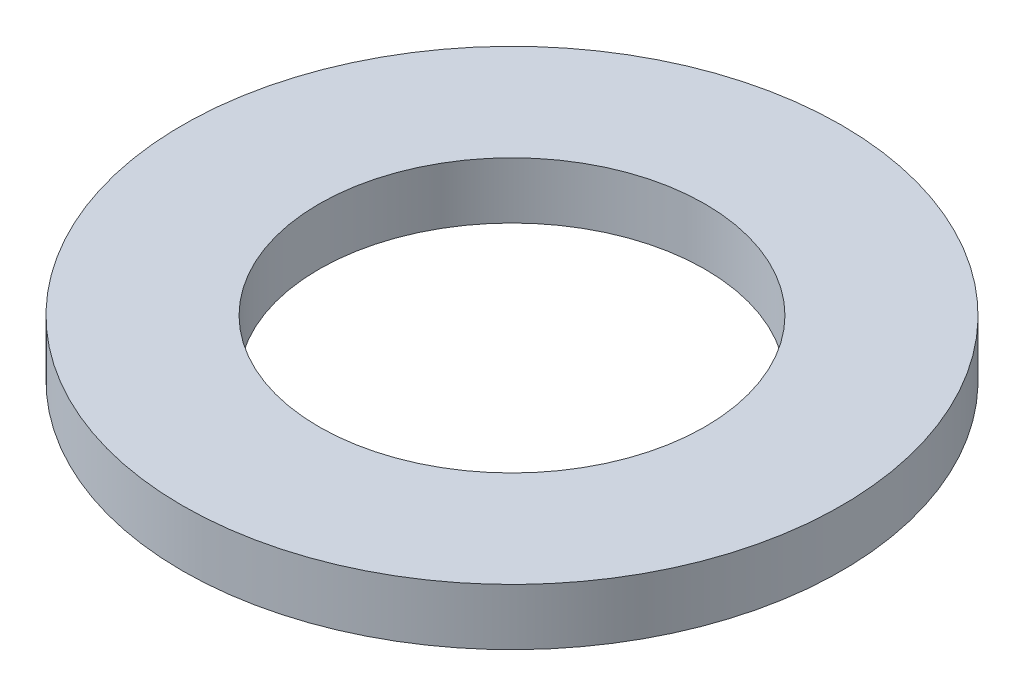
from build123d import *

# Parameters (mm, degrees)
SKETCH1_R      = 70
SKETCH1_R_2    = 41
EXTRUDE1_DEPTH = 12


with BuildPart() as part:
    # Sketch1 → Extrude1 (new body)
    with BuildSketch(Plane(origin=(0, 0, 0), x_dir=(1, 0, 0), z_dir=(0, 1, 0))):
        with Locations(Location((0, 0, 0), (0, 0, 270))):
            Circle(SKETCH1_R)
        with Locations(Location((0, 0, 0), (0, 0, 270))):
            Circle(SKETCH1_R_2, mode=Mode.SUBTRACT)
    extrude(amount=EXTRUDE1_DEPTH)


solid = part.part
